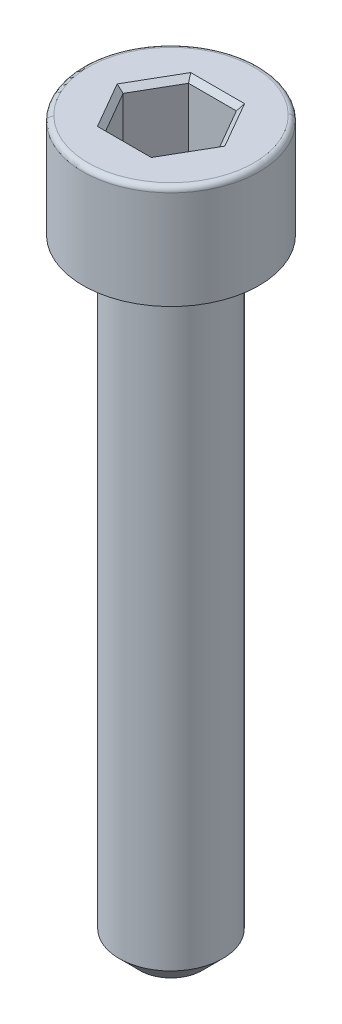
ISO-10303-21;
HEADER;
FILE_DESCRIPTION(('STEP AP214'),'2;1');
FILE_NAME('part.step','',(''),(''),'','','');
FILE_SCHEMA(('AUTOMOTIVE_DESIGN { 1 0 10303 214 1 1 1 1 }'));
ENDSEC;
DATA;
#1=APPLICATION_CONTEXT('core data for automotive mechanical design processes');
#2=APPLICATION_PROTOCOL_DEFINITION('international standard','automotive_design',2000,#1);
#3=PRODUCT_CONTEXT('',#1,'mechanical');
#4=PRODUCT('Part','Part','',(#3));
#5=PRODUCT_RELATED_PRODUCT_CATEGORY('part','',(#4));
#6=PRODUCT_DEFINITION_FORMATION('','',#4);
#7=PRODUCT_DEFINITION_CONTEXT('part definition',#1,'design');
#8=PRODUCT_DEFINITION('design','',#6,#7);
#9=PRODUCT_DEFINITION_SHAPE('','',#8);
#10=(LENGTH_UNIT() NAMED_UNIT(*) SI_UNIT(.MILLI.,.METRE.));
#11=(NAMED_UNIT(*) PLANE_ANGLE_UNIT() SI_UNIT($,.RADIAN.));
#12=(NAMED_UNIT(*) SI_UNIT($,.STERADIAN.) SOLID_ANGLE_UNIT());
#13=UNCERTAINTY_MEASURE_WITH_UNIT(LENGTH_MEASURE(1.E-05),#10,'distance_accuracy_value','');
#14=(GEOMETRIC_REPRESENTATION_CONTEXT(3) GLOBAL_UNCERTAINTY_ASSIGNED_CONTEXT((#13)) GLOBAL_UNIT_ASSIGNED_CONTEXT((#10,
#11,#12)) REPRESENTATION_CONTEXT('',''));
#15=CARTESIAN_POINT('',(0.,0.,0.));
#16=DIRECTION('',(0.,0.,1.));
#17=DIRECTION('',(1.,0.,0.));
#18=AXIS2_PLACEMENT_3D('',#15,#16,#17);
#19=CARTESIAN_POINT('',(32.8952994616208,38.75,7.5));
#20=DIRECTION('',(-0.612372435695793,-0.707106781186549,-0.353553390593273));
#21=DIRECTION('',(-0.5,0.,0.866025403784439));
#22=AXIS2_PLACEMENT_3D('',#19,#20,#21);
#23=PLANE('',#22);
#24=DIRECTION('',(-0.37796447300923,0.654653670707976,-0.654653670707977));
#25=VECTOR('',#24,1.);
#26=CARTESIAN_POINT('',(32.8952994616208,38.75,7.5));
#27=LINE('',#26,#25);
#28=CARTESIAN_POINT('',(32.8952994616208,38.75,7.5));
#29=VERTEX_POINT('',#28);
#30=CARTESIAN_POINT('',(32.7509618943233,39.,7.25));
#31=VERTEX_POINT('',#30);
#32=EDGE_CURVE('E24',#29,#31,#27,.T.);
#33=ORIENTED_EDGE('',*,*,#32,.T.);
#34=DIRECTION('',(0.5,0.,-0.866025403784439));
#35=VECTOR('',#34,1.);
#36=CARTESIAN_POINT('',(32.101442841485,39.,8.375));
#37=LINE('',#36,#35);
#38=CARTESIAN_POINT('',(31.4519237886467,39.,9.5));
#39=VERTEX_POINT('',#38);
#40=EDGE_CURVE('E278',#39,#31,#37,.T.);
#41=ORIENTED_EDGE('',*,*,#40,.F.);
#42=DIRECTION('',(0.755928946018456,-0.654653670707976,0.));
#43=VECTOR('',#42,1.);
#44=CARTESIAN_POINT('',(32.4004278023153,38.1785714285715,9.5));
#45=LINE('',#44,#43);
#46=CARTESIAN_POINT('',(31.7405989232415,38.75,9.5));
#47=VERTEX_POINT('',#46);
#48=EDGE_CURVE('E11',#39,#47,#45,.T.);
#49=ORIENTED_EDGE('',*,*,#48,.T.);
#50=DIRECTION('',(-0.5,0.,0.866025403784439));
#51=VECTOR('',#50,1.);
#52=CARTESIAN_POINT('',(32.8952994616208,38.75,7.5));
#53=LINE('',#52,#51);
#54=EDGE_CURVE('E308',#29,#47,#53,.T.);
#55=ORIENTED_EDGE('',*,*,#54,.F.);
#56=EDGE_LOOP('',(#33,#41,#49,#55));
#57=FACE_BOUND('',#56,.T.);
#58=ADVANCED_FACE('F16',(#57),#23,.F.);
#59=CARTESIAN_POINT('',(31.7405989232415,38.75,9.5));
#60=DIRECTION('',(-0.612372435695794,-0.707106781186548,0.353553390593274));
#61=DIRECTION('',(0.5,0.,0.866025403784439));
#62=AXIS2_PLACEMENT_3D('',#59,#60,#61);
#63=PLANE('',#62);
#64=DIRECTION('',(0.377964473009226,-0.654653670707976,-0.654653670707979));
#65=VECTOR('',#64,1.);
#66=CARTESIAN_POINT('',(32.8952994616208,38.75,11.5));
#67=LINE('',#66,#65);
#68=CARTESIAN_POINT('',(32.7509618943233,39.,11.75));
#69=VERTEX_POINT('',#68);
#70=CARTESIAN_POINT('',(32.8952994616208,38.75,11.5));
#71=VERTEX_POINT('',#70);
#72=EDGE_CURVE('E315',#69,#71,#67,.T.);
#73=ORIENTED_EDGE('',*,*,#72,.T.);
#74=DIRECTION('',(0.5,0.,0.866025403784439));
#75=VECTOR('',#74,1.);
#76=CARTESIAN_POINT('',(31.7405989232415,38.75,9.5));
#77=LINE('',#76,#75);
#78=EDGE_CURVE('E365',#47,#71,#77,.T.);
#79=ORIENTED_EDGE('',*,*,#78,.F.);
#80=ORIENTED_EDGE('',*,*,#48,.F.);
#81=DIRECTION('',(-0.5,0.,-0.866025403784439));
#82=VECTOR('',#81,1.);
#83=CARTESIAN_POINT('',(32.101442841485,39.,10.625));
#84=LINE('',#83,#82);
#85=EDGE_CURVE('E187',#69,#39,#84,.T.);
#86=ORIENTED_EDGE('',*,*,#85,.F.);
#87=EDGE_LOOP('',(#73,#79,#80,#86));
#88=FACE_BOUND('',#87,.T.);
#89=ADVANCED_FACE('F473',(#88),#63,.F.);
#90=CARTESIAN_POINT('',(35.2047005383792,38.75,7.5));
#91=DIRECTION('',(0.,-0.707106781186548,-0.707106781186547));
#92=DIRECTION('',(-1.,0.,0.));
#93=AXIS2_PLACEMENT_3D('',#90,#91,#92);
#94=PLANE('',#93);
#95=DIRECTION('',(0.377964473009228,0.654653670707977,-0.654653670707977));
#96=VECTOR('',#95,1.);
#97=CARTESIAN_POINT('',(35.2047005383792,38.75,7.5));
#98=LINE('',#97,#96);
#99=CARTESIAN_POINT('',(35.2047005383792,38.75,7.5));
#100=VERTEX_POINT('',#99);
#101=CARTESIAN_POINT('',(35.3490381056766,39.,7.25));
#102=VERTEX_POINT('',#101);
#103=EDGE_CURVE('E324',#100,#102,#98,.T.);
#104=ORIENTED_EDGE('',*,*,#103,.T.);
#105=DIRECTION('',(1.,0.,0.));
#106=VECTOR('',#105,1.);
#107=CARTESIAN_POINT('',(34.05,39.,7.25));
#108=LINE('',#107,#106);
#109=EDGE_CURVE('E282',#31,#102,#108,.T.);
#110=ORIENTED_EDGE('',*,*,#109,.F.);
#111=ORIENTED_EDGE('',*,*,#32,.F.);
#112=DIRECTION('',(-1.,0.,0.));
#113=VECTOR('',#112,1.);
#114=CARTESIAN_POINT('',(35.2047005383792,38.75,7.5));
#115=LINE('',#114,#113);
#116=EDGE_CURVE('E331',#100,#29,#115,.T.);
#117=ORIENTED_EDGE('',*,*,#116,.F.);
#118=EDGE_LOOP('',(#104,#110,#111,#117));
#119=FACE_BOUND('',#118,.T.);
#120=ADVANCED_FACE('F453',(#119),#94,.F.);
#121=CARTESIAN_POINT('',(32.8952994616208,38.75,11.5));
#122=DIRECTION('',(0.,-0.707106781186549,0.707106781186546));
#123=DIRECTION('',(1.,0.,0.));
#124=AXIS2_PLACEMENT_3D('',#121,#122,#123);
#125=PLANE('',#124);
#126=DIRECTION('',(-0.377964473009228,-0.654653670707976,-0.654653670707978));
#127=VECTOR('',#126,1.);
#128=CARTESIAN_POINT('',(35.2047005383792,38.75,11.5));
#129=LINE('',#128,#127);
#130=CARTESIAN_POINT('',(35.3490381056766,39.,11.75));
#131=VERTEX_POINT('',#130);
#132=CARTESIAN_POINT('',(35.2047005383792,38.75,11.5));
#133=VERTEX_POINT('',#132);
#134=EDGE_CURVE('E434',#131,#133,#129,.T.);
#135=ORIENTED_EDGE('',*,*,#134,.T.);
#136=DIRECTION('',(1.,0.,0.));
#137=VECTOR('',#136,1.);
#138=CARTESIAN_POINT('',(32.8952994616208,38.75,11.5));
#139=LINE('',#138,#137);
#140=EDGE_CURVE('E283',#71,#133,#139,.T.);
#141=ORIENTED_EDGE('',*,*,#140,.F.);
#142=ORIENTED_EDGE('',*,*,#72,.F.);
#143=DIRECTION('',(-1.,0.,0.));
#144=VECTOR('',#143,1.);
#145=CARTESIAN_POINT('',(34.05,39.,11.75));
#146=LINE('',#145,#144);
#147=EDGE_CURVE('E300',#131,#69,#146,.T.);
#148=ORIENTED_EDGE('',*,*,#147,.F.);
#149=EDGE_LOOP('',(#135,#141,#142,#148));
#150=FACE_BOUND('',#149,.T.);
#151=ADVANCED_FACE('F470',(#150),#125,.F.);
#152=CARTESIAN_POINT('',(36.3594010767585,38.75,9.5));
#153=DIRECTION('',(0.612372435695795,-0.707106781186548,-0.353553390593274));
#154=DIRECTION('',(-0.5,0.,-0.866025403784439));
#155=AXIS2_PLACEMENT_3D('',#152,#153,#154);
#156=PLANE('',#155);
#157=DIRECTION('',(0.755928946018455,0.654653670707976,0.));
#158=VECTOR('',#157,1.);
#159=CARTESIAN_POINT('',(36.3594010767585,38.75,9.5));
#160=LINE('',#159,#158);
#161=CARTESIAN_POINT('',(36.3594010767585,38.75,9.5));
#162=VERTEX_POINT('',#161);
#163=CARTESIAN_POINT('',(36.6480762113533,39.,9.5));
#164=VERTEX_POINT('',#163);
#165=EDGE_CURVE('E327',#162,#164,#160,.T.);
#166=ORIENTED_EDGE('',*,*,#165,.T.);
#167=DIRECTION('',(0.5,0.,0.866025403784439));
#168=VECTOR('',#167,1.);
#169=CARTESIAN_POINT('',(35.998557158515,39.,8.375));
#170=LINE('',#169,#168);
#171=EDGE_CURVE('E292',#102,#164,#170,.T.);
#172=ORIENTED_EDGE('',*,*,#171,.F.);
#173=ORIENTED_EDGE('',*,*,#103,.F.);
#174=DIRECTION('',(-0.5,0.,-0.866025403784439));
#175=VECTOR('',#174,1.);
#176=CARTESIAN_POINT('',(36.3594010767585,38.75,9.5));
#177=LINE('',#176,#175);
#178=EDGE_CURVE('E345',#162,#100,#177,.T.);
#179=ORIENTED_EDGE('',*,*,#178,.F.);
#180=EDGE_LOOP('',(#166,#172,#173,#179));
#181=FACE_BOUND('',#180,.T.);
#182=ADVANCED_FACE('F444',(#181),#156,.F.);
#183=CARTESIAN_POINT('',(35.2047005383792,38.75,11.5));
#184=DIRECTION('',(0.612372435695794,-0.707106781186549,0.353553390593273));
#185=DIRECTION('',(0.5,0.,-0.866025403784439));
#186=AXIS2_PLACEMENT_3D('',#183,#184,#185);
#187=PLANE('',#186);
#188=ORIENTED_EDGE('',*,*,#134,.F.);
#189=DIRECTION('',(-0.5,0.,0.866025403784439));
#190=VECTOR('',#189,1.);
#191=CARTESIAN_POINT('',(35.998557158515,39.,10.625));
#192=LINE('',#191,#190);
#193=EDGE_CURVE('E296',#164,#131,#192,.T.);
#194=ORIENTED_EDGE('',*,*,#193,.F.);
#195=ORIENTED_EDGE('',*,*,#165,.F.);
#196=DIRECTION('',(0.5,0.,-0.866025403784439));
#197=VECTOR('',#196,1.);
#198=CARTESIAN_POINT('',(35.2047005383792,38.75,11.5));
#199=LINE('',#198,#197);
#200=EDGE_CURVE('E240',#133,#162,#199,.T.);
#201=ORIENTED_EDGE('',*,*,#200,.F.);
#202=EDGE_LOOP('',(#188,#194,#195,#201));
#203=FACE_BOUND('',#202,.T.);
#204=ADVANCED_FACE('F447',(#203),#187,.F.);
#205=CARTESIAN_POINT('',(34.9881941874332,35.75,7.625));
#206=DIRECTION('',(-0.5,0.,-0.866025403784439));
#207=DIRECTION('',(0.866025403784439,0.,-0.5));
#208=AXIS2_PLACEMENT_3D('',#205,#206,#207);
#209=CYLINDRICAL_SURFACE('',#208,0.25);
#210=CARTESIAN_POINT('',(36.0707259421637,35.5,9.5));
#211=CARTESIAN_POINT('',(36.2398279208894,35.5000000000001,9.5));
#212=CARTESIAN_POINT('',(36.3594010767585,35.6035533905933,9.5));
#213=CARTESIAN_POINT('',(36.3594010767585,35.75,9.5));
#214=(BOUNDED_CURVE() B_SPLINE_CURVE(3,(#210,#211,#212,#213),.UNSPECIFIED.,.F.,
.F.) B_SPLINE_CURVE_WITH_KNOTS((4,4),(1.5707963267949,3.1415926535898),
.UNSPECIFIED.) CURVE() GEOMETRIC_REPRESENTATION_ITEM() RATIONAL_B_SPLINE_CURVE((1.,
0.804737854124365,0.804737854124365,1.)) REPRESENTATION_ITEM(''));
#215=CARTESIAN_POINT('',(36.0707259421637,35.5,9.5));
#216=VERTEX_POINT('',#215);
#217=CARTESIAN_POINT('',(36.3594010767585,35.75,9.5));
#218=VERTEX_POINT('',#217);
#219=EDGE_CURVE('E418',#216,#218,#214,.T.);
#220=ORIENTED_EDGE('',*,*,#219,.T.);
#221=DIRECTION('',(0.5,0.,0.866025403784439));
#222=VECTOR('',#221,1.);
#223=CARTESIAN_POINT('',(36.3594010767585,35.75,9.5));
#224=LINE('',#223,#222);
#225=CARTESIAN_POINT('',(35.2047005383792,35.75,7.5));
#226=VERTEX_POINT('',#225);
#227=EDGE_CURVE('E349',#226,#218,#224,.T.);
#228=ORIENTED_EDGE('',*,*,#227,.F.);
#229=CARTESIAN_POINT('',(35.2047005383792,35.75,7.5));
#230=CARTESIAN_POINT('',(35.2047005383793,35.6035533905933,7.49999999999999));
#231=CARTESIAN_POINT('',(35.1449139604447,35.5,7.60355339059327));
#232=CARTESIAN_POINT('',(35.0603629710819,35.5,7.75));
#233=(BOUNDED_CURVE() B_SPLINE_CURVE(3,(#229,#230,#231,#232),.UNSPECIFIED.,.F.,
.F.) B_SPLINE_CURVE_WITH_KNOTS((4,4),(0.,1.5707963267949),
.UNSPECIFIED.) CURVE() GEOMETRIC_REPRESENTATION_ITEM() RATIONAL_B_SPLINE_CURVE((1.,
0.804737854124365,0.804737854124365,1.)) REPRESENTATION_ITEM(''));
#234=CARTESIAN_POINT('',(35.0603629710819,35.5,7.75));
#235=VERTEX_POINT('',#234);
#236=EDGE_CURVE('E426',#226,#235,#233,.T.);
#237=ORIENTED_EDGE('',*,*,#236,.T.);
#238=DIRECTION('',(-0.5,0.,-0.866025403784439));
#239=VECTOR('',#238,1.);
#240=CARTESIAN_POINT('',(34.9881941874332,35.5,7.625));
#241=LINE('',#240,#239);
#242=EDGE_CURVE('E260',#216,#235,#241,.T.);
#243=ORIENTED_EDGE('',*,*,#242,.F.);
#244=EDGE_LOOP('',(#220,#228,#237,#243));
#245=FACE_BOUND('',#244,.T.);
#246=ADVANCED_FACE('F489',(#245),#209,.F.);
#247=CARTESIAN_POINT('',(31.7405989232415,35.75,7.75));
#248=DIRECTION('',(-1.,0.,0.));
#249=DIRECTION('',(0.,0.,-1.));
#250=AXIS2_PLACEMENT_3D('',#247,#248,#249);
#251=CYLINDRICAL_SURFACE('',#250,0.25);
#252=CARTESIAN_POINT('',(32.8952994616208,35.75,7.5));
#253=CARTESIAN_POINT('',(32.8952994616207,35.6035533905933,7.5));
#254=CARTESIAN_POINT('',(32.9550860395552,35.5000000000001,7.60355339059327));
#255=CARTESIAN_POINT('',(33.0396370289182,35.5,7.75));
#256=(BOUNDED_CURVE() B_SPLINE_CURVE(3,(#252,#253,#254,#255),.UNSPECIFIED.,.F.,
.F.) B_SPLINE_CURVE_WITH_KNOTS((4,4),(0.,1.5707963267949),
.UNSPECIFIED.) CURVE() GEOMETRIC_REPRESENTATION_ITEM() RATIONAL_B_SPLINE_CURVE((1.,
0.804737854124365,0.804737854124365,1.)) REPRESENTATION_ITEM(''));
#257=CARTESIAN_POINT('',(32.8952994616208,35.75,7.5));
#258=VERTEX_POINT('',#257);
#259=CARTESIAN_POINT('',(33.0396370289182,35.5,7.75));
#260=VERTEX_POINT('',#259);
#261=EDGE_CURVE('E410',#258,#260,#256,.T.);
#262=ORIENTED_EDGE('',*,*,#261,.T.);
#263=DIRECTION('',(-1.,0.,0.));
#264=VECTOR('',#263,1.);
#265=CARTESIAN_POINT('',(31.7405989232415,35.5,7.75));
#266=LINE('',#265,#264);
#267=EDGE_CURVE('E264',#235,#260,#266,.T.);
#268=ORIENTED_EDGE('',*,*,#267,.F.);
#269=ORIENTED_EDGE('',*,*,#236,.F.);
#270=DIRECTION('',(1.,0.,0.));
#271=VECTOR('',#270,1.);
#272=CARTESIAN_POINT('',(35.2047005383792,35.75,7.5));
#273=LINE('',#272,#271);
#274=EDGE_CURVE('E337',#258,#226,#273,.T.);
#275=ORIENTED_EDGE('',*,*,#274,.F.);
#276=EDGE_LOOP('',(#262,#268,#269,#275));
#277=FACE_BOUND('',#276,.T.);
#278=ADVANCED_FACE('F485',(#277),#251,.F.);
#279=CARTESIAN_POINT('',(34.9881941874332,35.75,11.375));
#280=DIRECTION('',(0.5,0.,-0.866025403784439));
#281=DIRECTION('',(0.866025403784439,0.,0.5));
#282=AXIS2_PLACEMENT_3D('',#279,#280,#281);
#283=CYLINDRICAL_SURFACE('',#282,0.25);
#284=CARTESIAN_POINT('',(35.0603629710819,35.5,11.25));
#285=CARTESIAN_POINT('',(35.1449139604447,35.5000000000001,11.3964466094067));
#286=CARTESIAN_POINT('',(35.2047005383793,35.6035533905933,11.5));
#287=CARTESIAN_POINT('',(35.2047005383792,35.75,11.5));
#288=(BOUNDED_CURVE() B_SPLINE_CURVE(3,(#284,#285,#286,#287),.UNSPECIFIED.,.F.,
.F.) B_SPLINE_CURVE_WITH_KNOTS((4,4),(4.71238898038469,6.28318530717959),
.UNSPECIFIED.) CURVE() GEOMETRIC_REPRESENTATION_ITEM() RATIONAL_B_SPLINE_CURVE((1.,
0.804737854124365,0.804737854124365,1.)) REPRESENTATION_ITEM(''));
#289=CARTESIAN_POINT('',(35.0603629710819,35.5,11.25));
#290=VERTEX_POINT('',#289);
#291=CARTESIAN_POINT('',(35.2047005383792,35.75,11.5));
#292=VERTEX_POINT('',#291);
#293=EDGE_CURVE('E402',#290,#292,#288,.T.);
#294=ORIENTED_EDGE('',*,*,#293,.T.);
#295=DIRECTION('',(-0.5,0.,0.866025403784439));
#296=VECTOR('',#295,1.);
#297=CARTESIAN_POINT('',(35.2047005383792,35.75,11.5));
#298=LINE('',#297,#296);
#299=EDGE_CURVE('E244',#218,#292,#298,.T.);
#300=ORIENTED_EDGE('',*,*,#299,.F.);
#301=ORIENTED_EDGE('',*,*,#219,.F.);
#302=DIRECTION('',(0.5,0.,-0.866025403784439));
#303=VECTOR('',#302,1.);
#304=CARTESIAN_POINT('',(34.9881941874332,35.5,11.375));
#305=LINE('',#304,#303);
#306=EDGE_CURVE('E265',#290,#216,#305,.T.);
#307=ORIENTED_EDGE('',*,*,#306,.F.);
#308=EDGE_LOOP('',(#294,#300,#301,#307));
#309=FACE_BOUND('',#308,.T.);
#310=ADVANCED_FACE('F492',(#309),#283,.F.);
#311=CARTESIAN_POINT('',(31.9571052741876,35.75,9.625));
#312=DIRECTION('',(-0.5,0.,0.866025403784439));
#313=DIRECTION('',(-0.866025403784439,0.,-0.5));
#314=AXIS2_PLACEMENT_3D('',#311,#312,#313);
#315=CYLINDRICAL_SURFACE('',#314,0.25);
#316=CARTESIAN_POINT('',(31.7405989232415,35.75,9.5));
#317=CARTESIAN_POINT('',(31.7405989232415,35.6035533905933,9.5));
#318=CARTESIAN_POINT('',(31.8601720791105,35.5000000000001,9.5));
#319=CARTESIAN_POINT('',(32.0292740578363,35.5,9.5));
#320=(BOUNDED_CURVE() B_SPLINE_CURVE(3,(#316,#317,#318,#319),.UNSPECIFIED.,.F.,
.F.) B_SPLINE_CURVE_WITH_KNOTS((4,4),(0.,1.5707963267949),
.UNSPECIFIED.) CURVE() GEOMETRIC_REPRESENTATION_ITEM() RATIONAL_B_SPLINE_CURVE((1.,
0.804737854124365,0.804737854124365,1.)) REPRESENTATION_ITEM(''));
#321=CARTESIAN_POINT('',(31.7405989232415,35.75,9.5));
#322=VERTEX_POINT('',#321);
#323=CARTESIAN_POINT('',(32.0292740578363,35.5,9.5));
#324=VERTEX_POINT('',#323);
#325=EDGE_CURVE('E43',#322,#324,#320,.T.);
#326=ORIENTED_EDGE('',*,*,#325,.T.);
#327=DIRECTION('',(-0.5,0.,0.866025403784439));
#328=VECTOR('',#327,1.);
#329=CARTESIAN_POINT('',(31.9571052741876,35.5,9.625));
#330=LINE('',#329,#328);
#331=EDGE_CURVE('E379',#260,#324,#330,.T.);
#332=ORIENTED_EDGE('',*,*,#331,.F.);
#333=ORIENTED_EDGE('',*,*,#261,.F.);
#334=DIRECTION('',(0.5,0.,-0.866025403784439));
#335=VECTOR('',#334,1.);
#336=CARTESIAN_POINT('',(32.8952994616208,35.75,7.5));
#337=LINE('',#336,#335);
#338=EDGE_CURVE('E319',#322,#258,#337,.T.);
#339=ORIENTED_EDGE('',*,*,#338,.F.);
#340=EDGE_LOOP('',(#326,#332,#333,#339));
#341=FACE_BOUND('',#340,.T.);
#342=ADVANCED_FACE('F498',(#341),#315,.F.);
#343=CARTESIAN_POINT('',(31.7405989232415,35.75,11.25));
#344=DIRECTION('',(1.,0.,0.));
#345=DIRECTION('',(0.,0.,1.));
#346=AXIS2_PLACEMENT_3D('',#343,#344,#345);
#347=CYLINDRICAL_SURFACE('',#346,0.25);
#348=CARTESIAN_POINT('',(33.0396370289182,35.5,11.25));
#349=CARTESIAN_POINT('',(32.9550860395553,35.5,11.3964466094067));
#350=CARTESIAN_POINT('',(32.8952994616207,35.6035533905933,11.5));
#351=CARTESIAN_POINT('',(32.8952994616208,35.75,11.5));
#352=(BOUNDED_CURVE() B_SPLINE_CURVE(3,(#348,#349,#350,#351),.UNSPECIFIED.,.F.,
.F.) B_SPLINE_CURVE_WITH_KNOTS((4,4),(4.71238898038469,6.28318530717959),
.UNSPECIFIED.) CURVE() GEOMETRIC_REPRESENTATION_ITEM() RATIONAL_B_SPLINE_CURVE((1.,
0.804737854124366,0.804737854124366,1.)) REPRESENTATION_ITEM(''));
#353=CARTESIAN_POINT('',(33.0396370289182,35.5,11.25));
#354=VERTEX_POINT('',#353);
#355=CARTESIAN_POINT('',(32.8952994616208,35.75,11.5));
#356=VERTEX_POINT('',#355);
#357=EDGE_CURVE('E34',#354,#356,#352,.T.);
#358=ORIENTED_EDGE('',*,*,#357,.T.);
#359=DIRECTION('',(-1.,0.,0.));
#360=VECTOR('',#359,1.);
#361=CARTESIAN_POINT('',(32.8952994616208,35.75,11.5));
#362=LINE('',#361,#360);
#363=EDGE_CURVE('E287',#292,#356,#362,.T.);
#364=ORIENTED_EDGE('',*,*,#363,.F.);
#365=ORIENTED_EDGE('',*,*,#293,.F.);
#366=DIRECTION('',(1.,0.,0.));
#367=VECTOR('',#366,1.);
#368=CARTESIAN_POINT('',(31.7405989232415,35.5,11.25));
#369=LINE('',#368,#367);
#370=EDGE_CURVE('E387',#354,#290,#369,.T.);
#371=ORIENTED_EDGE('',*,*,#370,.F.);
#372=EDGE_LOOP('',(#358,#364,#365,#371));
#373=FACE_BOUND('',#372,.T.);
#374=ADVANCED_FACE('F494',(#373),#347,.F.);
#375=CARTESIAN_POINT('',(31.9571052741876,35.75,9.375));
#376=DIRECTION('',(0.5,0.,0.866025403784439));
#377=DIRECTION('',(-0.866025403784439,0.,0.5));
#378=AXIS2_PLACEMENT_3D('',#375,#376,#377);
#379=CYLINDRICAL_SURFACE('',#378,0.25);
#380=ORIENTED_EDGE('',*,*,#325,.F.);
#381=DIRECTION('',(-0.5,0.,-0.866025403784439));
#382=VECTOR('',#381,1.);
#383=CARTESIAN_POINT('',(31.7405989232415,35.75,9.5));
#384=LINE('',#383,#382);
#385=EDGE_CURVE('E369',#356,#322,#384,.T.);
#386=ORIENTED_EDGE('',*,*,#385,.F.);
#387=ORIENTED_EDGE('',*,*,#357,.F.);
#388=DIRECTION('',(0.5,0.,0.866025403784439));
#389=VECTOR('',#388,1.);
#390=CARTESIAN_POINT('',(31.9571052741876,35.5,9.375));
#391=LINE('',#390,#389);
#392=EDGE_CURVE('E383',#324,#354,#391,.T.);
#393=ORIENTED_EDGE('',*,*,#392,.F.);
#394=EDGE_LOOP('',(#380,#386,#387,#393));
#395=FACE_BOUND('',#394,.T.);
#396=ADVANCED_FACE('F495',(#395),#379,.F.);
#397=CARTESIAN_POINT('',(34.05,38.75,9.5));
#398=DIRECTION('',(0.,-1.,0.));
#399=DIRECTION('',(0.696510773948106,0.,-0.717546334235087));
#400=AXIS2_PLACEMENT_3D('',#397,#398,#399);
#401=TOROIDAL_SURFACE('',#400,4.,0.25);
#402=CARTESIAN_POINT('',(31.2639569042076,38.75,12.3701853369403));
#403=DIRECTION('',(0.717546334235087,0.,0.696510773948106));
#404=DIRECTION('',(-0.696510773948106,0.,0.717546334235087));
#405=AXIS2_PLACEMENT_3D('',#402,#403,#404);
#406=CIRCLE('',#405,0.25);
#407=CARTESIAN_POINT('',(31.2639569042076,39.,12.3701853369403));
#408=VERTEX_POINT('',#407);
#409=CARTESIAN_POINT('',(31.0898292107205,38.75,12.5495719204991));
#410=VERTEX_POINT('',#409);
#411=EDGE_CURVE('E191',#408,#410,#406,.T.);
#412=ORIENTED_EDGE('',*,*,#411,.F.);
#413=CARTESIAN_POINT('',(34.05,39.,9.5));
#414=DIRECTION('',(0.,1.,0.));
#415=DIRECTION('',(0.696510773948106,0.,-0.717546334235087));
#416=AXIS2_PLACEMENT_3D('',#413,#414,#415);
#417=CIRCLE('',#416,4.);
#418=CARTESIAN_POINT('',(36.8360430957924,39.,6.62981466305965));
#419=VERTEX_POINT('',#418);
#420=EDGE_CURVE('E178',#419,#408,#417,.T.);
#421=ORIENTED_EDGE('',*,*,#420,.F.);
#422=CARTESIAN_POINT('',(36.8360430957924,38.75,6.62981466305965));
#423=DIRECTION('',(-0.717546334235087,0.,-0.696510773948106));
#424=DIRECTION('',(0.,1.,0.));
#425=AXIS2_PLACEMENT_3D('',#422,#423,#424);
#426=CIRCLE('',#425,0.25);
#427=CARTESIAN_POINT('',(37.0101707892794,38.75,6.45042807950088));
#428=VERTEX_POINT('',#427);
#429=EDGE_CURVE('E200',#419,#428,#426,.T.);
#430=ORIENTED_EDGE('',*,*,#429,.T.);
#431=CARTESIAN_POINT('',(34.05,38.75,9.5));
#432=DIRECTION('',(0.,-1.,0.));
#433=DIRECTION('',(0.696510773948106,0.,-0.717546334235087));
#434=AXIS2_PLACEMENT_3D('',#431,#432,#433);
#435=CIRCLE('',#434,4.25);
#436=EDGE_CURVE('E188',#410,#428,#435,.T.);
#437=ORIENTED_EDGE('',*,*,#436,.F.);
#438=EDGE_LOOP('',(#412,#421,#430,#437));
#439=FACE_BOUND('',#438,.T.);
#440=ADVANCED_FACE('F192',(#439),#401,.T.);
#441=CARTESIAN_POINT('',(34.05,4.,9.5));
#442=DIRECTION('',(0.,1.,0.));
#443=DIRECTION('',(-0.696510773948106,0.,0.717546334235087));
#444=AXIS2_PLACEMENT_3D('',#441,#442,#443);
#445=CONICAL_SURFACE('',#444,1.49999999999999,0.785398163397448);
#446=DIRECTION('',(0.492507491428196,0.707106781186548,-0.507381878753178));
#447=VECTOR('',#446,1.);
#448=CARTESIAN_POINT('',(35.0947661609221,4.,8.42368049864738));
#449=LINE('',#448,#447);
#450=CARTESIAN_POINT('',(35.0947661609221,4.,8.42368049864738));
#451=VERTEX_POINT('',#450);
#452=CARTESIAN_POINT('',(35.7912769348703,5.,7.70613416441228));
#453=VERTEX_POINT('',#452);
#454=EDGE_CURVE('E223',#451,#453,#449,.T.);
#455=ORIENTED_EDGE('',*,*,#454,.F.);
#456=CARTESIAN_POINT('',(34.05,4.,9.5));
#457=DIRECTION('',(0.,-1.,0.));
#458=DIRECTION('',(0.696510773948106,0.,-0.717546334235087));
#459=AXIS2_PLACEMENT_3D('',#456,#457,#458);
#460=CIRCLE('',#459,1.49999999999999);
#461=CARTESIAN_POINT('',(33.0052338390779,4.,10.5763195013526));
#462=VERTEX_POINT('',#461);
#463=EDGE_CURVE('E256',#462,#451,#460,.T.);
#464=ORIENTED_EDGE('',*,*,#463,.F.);
#465=DIRECTION('',(-0.492507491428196,0.707106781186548,0.507381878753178));
#466=VECTOR('',#465,1.);
#467=CARTESIAN_POINT('',(33.0052338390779,4.,10.5763195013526));
#468=LINE('',#467,#466);
#469=CARTESIAN_POINT('',(32.3087230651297,5.,11.2938658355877));
#470=VERTEX_POINT('',#469);
#471=EDGE_CURVE('E231',#462,#470,#468,.T.);
#472=ORIENTED_EDGE('',*,*,#471,.T.);
#473=CARTESIAN_POINT('',(34.05,5.,9.5));
#474=DIRECTION('',(0.,1.,0.));
#475=DIRECTION('',(0.696510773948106,0.,-0.717546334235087));
#476=AXIS2_PLACEMENT_3D('',#473,#474,#475);
#477=CIRCLE('',#476,2.5);
#478=EDGE_CURVE('E213',#453,#470,#477,.T.);
#479=ORIENTED_EDGE('',*,*,#478,.F.);
#480=EDGE_LOOP('',(#455,#464,#472,#479));
#481=FACE_BOUND('',#480,.T.);
#482=ADVANCED_FACE('F502',(#481),#445,.T.);
#483=CARTESIAN_POINT('',(31.7405989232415,35.5,9.5));
#484=DIRECTION('',(0.,1.,0.));
#485=DIRECTION('',(-0.717546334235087,0.,-0.696510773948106));
#486=AXIS2_PLACEMENT_3D('',#483,#484,#485);
#487=PLANE('',#486);
#488=ORIENTED_EDGE('',*,*,#306,.T.);
#489=ORIENTED_EDGE('',*,*,#242,.T.);
#490=ORIENTED_EDGE('',*,*,#267,.T.);
#491=ORIENTED_EDGE('',*,*,#331,.T.);
#492=ORIENTED_EDGE('',*,*,#392,.T.);
#493=ORIENTED_EDGE('',*,*,#370,.T.);
#494=EDGE_LOOP('',(#488,#489,#490,#491,#492,#493));
#495=FACE_BOUND('',#494,.T.);
#496=ADVANCED_FACE('F500',(#495),#487,.T.);
#497=CARTESIAN_POINT('',(31.7405989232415,35.5,9.5));
#498=DIRECTION('',(-0.866025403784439,0.,0.5));
#499=DIRECTION('',(0.5,0.,0.866025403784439));
#500=AXIS2_PLACEMENT_3D('',#497,#498,#499);
#501=PLANE('',#500);
#502=DIRECTION('',(0.,1.,0.));
#503=VECTOR('',#502,1.);
#504=CARTESIAN_POINT('',(31.7405989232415,35.5,9.5));
#505=LINE('',#504,#503);
#506=EDGE_CURVE('E312',#322,#47,#505,.T.);
#507=ORIENTED_EDGE('',*,*,#506,.T.);
#508=ORIENTED_EDGE('',*,*,#78,.T.);
#509=DIRECTION('',(0.,1.,0.));
#510=VECTOR('',#509,1.);
#511=CARTESIAN_POINT('',(32.8952994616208,35.5,11.5));
#512=LINE('',#511,#510);
#513=EDGE_CURVE('E288',#356,#71,#512,.T.);
#514=ORIENTED_EDGE('',*,*,#513,.F.);
#515=ORIENTED_EDGE('',*,*,#385,.T.);
#516=EDGE_LOOP('',(#507,#508,#514,#515));
#517=FACE_BOUND('',#516,.T.);
#518=ADVANCED_FACE('F497',(#517),#501,.F.);
#519=CARTESIAN_POINT('',(32.8952994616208,35.5,11.5));
#520=DIRECTION('',(0.,0.,1.));
#521=DIRECTION('',(0.,-1.,0.));
#522=AXIS2_PLACEMENT_3D('',#519,#520,#521);
#523=PLANE('',#522);
#524=ORIENTED_EDGE('',*,*,#513,.T.);
#525=ORIENTED_EDGE('',*,*,#140,.T.);
#526=DIRECTION('',(0.,1.,0.));
#527=VECTOR('',#526,1.);
#528=CARTESIAN_POINT('',(35.2047005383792,35.5,11.5));
#529=LINE('',#528,#527);
#530=EDGE_CURVE('E245',#292,#133,#529,.T.);
#531=ORIENTED_EDGE('',*,*,#530,.F.);
#532=ORIENTED_EDGE('',*,*,#363,.T.);
#533=EDGE_LOOP('',(#524,#525,#531,#532));
#534=FACE_BOUND('',#533,.T.);
#535=ADVANCED_FACE('F465',(#534),#523,.F.);
#536=CARTESIAN_POINT('',(35.2047005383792,35.5,11.5));
#537=DIRECTION('',(0.866025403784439,0.,0.5));
#538=DIRECTION('',(0.,1.,0.));
#539=AXIS2_PLACEMENT_3D('',#536,#537,#538);
#540=PLANE('',#539);
#541=ORIENTED_EDGE('',*,*,#530,.T.);
#542=ORIENTED_EDGE('',*,*,#200,.T.);
#543=DIRECTION('',(0.,1.,0.));
#544=VECTOR('',#543,1.);
#545=CARTESIAN_POINT('',(36.3594010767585,35.5,9.5));
#546=LINE('',#545,#544);
#547=EDGE_CURVE('E341',#218,#162,#546,.T.);
#548=ORIENTED_EDGE('',*,*,#547,.F.);
#549=ORIENTED_EDGE('',*,*,#299,.T.);
#550=EDGE_LOOP('',(#541,#542,#548,#549));
#551=FACE_BOUND('',#550,.T.);
#552=ADVANCED_FACE('F461',(#551),#540,.F.);
#553=CARTESIAN_POINT('',(36.3594010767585,35.5,9.5));
#554=DIRECTION('',(0.866025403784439,0.,-0.5));
#555=DIRECTION('',(0.,1.,0.));
#556=AXIS2_PLACEMENT_3D('',#553,#554,#555);
#557=PLANE('',#556);
#558=ORIENTED_EDGE('',*,*,#547,.T.);
#559=ORIENTED_EDGE('',*,*,#178,.T.);
#560=DIRECTION('',(0.,1.,0.));
#561=VECTOR('',#560,1.);
#562=CARTESIAN_POINT('',(35.2047005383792,35.5,7.5));
#563=LINE('',#562,#561);
#564=EDGE_CURVE('E323',#226,#100,#563,.T.);
#565=ORIENTED_EDGE('',*,*,#564,.F.);
#566=ORIENTED_EDGE('',*,*,#227,.T.);
#567=EDGE_LOOP('',(#558,#559,#565,#566));
#568=FACE_BOUND('',#567,.T.);
#569=ADVANCED_FACE('F457',(#568),#557,.F.);
#570=CARTESIAN_POINT('',(35.2047005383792,35.5,7.5));
#571=DIRECTION('',(0.,0.,-1.));
#572=DIRECTION('',(0.,1.,0.));
#573=AXIS2_PLACEMENT_3D('',#570,#571,#572);
#574=PLANE('',#573);
#575=ORIENTED_EDGE('',*,*,#564,.T.);
#576=ORIENTED_EDGE('',*,*,#116,.T.);
#577=DIRECTION('',(0.,1.,0.));
#578=VECTOR('',#577,1.);
#579=CARTESIAN_POINT('',(32.8952994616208,35.5,7.5));
#580=LINE('',#579,#578);
#581=EDGE_CURVE('E304',#258,#29,#580,.T.);
#582=ORIENTED_EDGE('',*,*,#581,.F.);
#583=ORIENTED_EDGE('',*,*,#274,.T.);
#584=EDGE_LOOP('',(#575,#576,#582,#583));
#585=FACE_BOUND('',#584,.T.);
#586=ADVANCED_FACE('F482',(#585),#574,.F.);
#587=CARTESIAN_POINT('',(32.8952994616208,35.5,7.5));
#588=DIRECTION('',(-0.866025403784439,0.,-0.5));
#589=DIRECTION('',(-0.5,0.,0.866025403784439));
#590=AXIS2_PLACEMENT_3D('',#587,#588,#589);
#591=PLANE('',#590);
#592=ORIENTED_EDGE('',*,*,#581,.T.);
#593=ORIENTED_EDGE('',*,*,#54,.T.);
#594=ORIENTED_EDGE('',*,*,#506,.F.);
#595=ORIENTED_EDGE('',*,*,#338,.T.);
#596=EDGE_LOOP('',(#592,#593,#594,#595));
#597=FACE_BOUND('',#596,.T.);
#598=ADVANCED_FACE('F480',(#597),#591,.F.);
#599=CARTESIAN_POINT('',(34.05,39.,9.5));
#600=DIRECTION('',(0.,-1.,0.));
#601=DIRECTION('',(0.696510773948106,0.,-0.717546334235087));
#602=AXIS2_PLACEMENT_3D('',#599,#600,#601);
#603=PLANE('',#602);
#604=ORIENTED_EDGE('',*,*,#85,.T.);
#605=ORIENTED_EDGE('',*,*,#40,.T.);
#606=ORIENTED_EDGE('',*,*,#109,.T.);
#607=ORIENTED_EDGE('',*,*,#171,.T.);
#608=ORIENTED_EDGE('',*,*,#193,.T.);
#609=ORIENTED_EDGE('',*,*,#147,.T.);
#610=EDGE_LOOP('',(#604,#605,#606,#607,#608,#609));
#611=FACE_BOUND('',#610,.T.);
#612=ORIENTED_EDGE('',*,*,#420,.T.);
#613=CARTESIAN_POINT('',(34.05,39.,9.5));
#614=DIRECTION('',(0.,1.,0.));
#615=DIRECTION('',(0.696510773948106,0.,-0.717546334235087));
#616=AXIS2_PLACEMENT_3D('',#613,#614,#615);
#617=CIRCLE('',#616,4.);
#618=EDGE_CURVE('E182',#408,#419,#617,.T.);
#619=ORIENTED_EDGE('',*,*,#618,.T.);
#620=EDGE_LOOP('',(#612,#619));
#621=FACE_BOUND('',#620,.T.);
#622=ADVANCED_FACE('F180',(#611,#621),#603,.F.);
#623=CARTESIAN_POINT('',(34.05,39.,9.5));
#624=DIRECTION('',(0.,-1.,0.));
#625=DIRECTION('',(0.696510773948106,0.,-0.717546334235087));
#626=AXIS2_PLACEMENT_3D('',#623,#624,#625);
#627=CYLINDRICAL_SURFACE('',#626,4.25);
#628=DIRECTION('',(0.,-1.,0.));
#629=VECTOR('',#628,1.);
#630=CARTESIAN_POINT('',(31.0898292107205,39.,12.5495719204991));
#631=LINE('',#630,#629);
#632=CARTESIAN_POINT('',(31.0898292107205,34.,12.5495719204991));
#633=VERTEX_POINT('',#632);
#634=EDGE_CURVE('E235',#410,#633,#631,.T.);
#635=ORIENTED_EDGE('',*,*,#634,.F.);
#636=ORIENTED_EDGE('',*,*,#436,.T.);
#637=DIRECTION('',(0.,-1.,0.));
#638=VECTOR('',#637,1.);
#639=CARTESIAN_POINT('',(37.0101707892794,39.,6.45042807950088));
#640=LINE('',#639,#638);
#641=CARTESIAN_POINT('',(37.0101707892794,34.,6.45042807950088));
#642=VERTEX_POINT('',#641);
#643=EDGE_CURVE('E249',#428,#642,#640,.T.);
#644=ORIENTED_EDGE('',*,*,#643,.T.);
#645=CARTESIAN_POINT('',(34.05,34.,9.5));
#646=DIRECTION('',(0.,-1.,0.));
#647=DIRECTION('',(0.696510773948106,0.,-0.717546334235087));
#648=AXIS2_PLACEMENT_3D('',#645,#646,#647);
#649=CIRCLE('',#648,4.25);
#650=EDGE_CURVE('E270',#633,#642,#649,.T.);
#651=ORIENTED_EDGE('',*,*,#650,.F.);
#652=EDGE_LOOP('',(#635,#636,#644,#651));
#653=FACE_BOUND('',#652,.T.);
#654=ADVANCED_FACE('F529',(#653),#627,.T.);
#655=CARTESIAN_POINT('',(34.05,34.,9.5));
#656=DIRECTION('',(0.,-1.,0.));
#657=DIRECTION('',(0.696510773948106,0.,-0.717546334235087));
#658=AXIS2_PLACEMENT_3D('',#655,#656,#657);
#659=PLANE('',#658);
#660=CARTESIAN_POINT('',(34.05,34.,9.5));
#661=DIRECTION('',(0.,-1.,0.));
#662=DIRECTION('',(0.696510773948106,0.,-0.717546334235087));
#663=AXIS2_PLACEMENT_3D('',#660,#661,#662);
#664=CIRCLE('',#663,2.5);
#665=CARTESIAN_POINT('',(32.3087230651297,34.,11.2938658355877));
#666=VERTEX_POINT('',#665);
#667=CARTESIAN_POINT('',(35.7912769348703,34.,7.70613416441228));
#668=VERTEX_POINT('',#667);
#669=EDGE_CURVE('E253',#666,#668,#664,.T.);
#670=ORIENTED_EDGE('',*,*,#669,.F.);
#671=CARTESIAN_POINT('',(34.05,34.,9.5));
#672=DIRECTION('',(0.,-1.,0.));
#673=DIRECTION('',(0.696510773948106,0.,-0.717546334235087));
#674=AXIS2_PLACEMENT_3D('',#671,#672,#673);
#675=CIRCLE('',#674,2.5);
#676=EDGE_CURVE('E205',#668,#666,#675,.T.);
#677=ORIENTED_EDGE('',*,*,#676,.F.);
#678=EDGE_LOOP('',(#670,#677));
#679=FACE_BOUND('',#678,.T.);
#680=CARTESIAN_POINT('',(34.05,34.,9.5));
#681=DIRECTION('',(0.,-1.,0.));
#682=DIRECTION('',(0.696510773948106,0.,-0.717546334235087));
#683=AXIS2_PLACEMENT_3D('',#680,#681,#682);
#684=CIRCLE('',#683,4.25);
#685=EDGE_CURVE('E239',#642,#633,#684,.T.);
#686=ORIENTED_EDGE('',*,*,#685,.T.);
#687=ORIENTED_EDGE('',*,*,#650,.T.);
#688=EDGE_LOOP('',(#686,#687));
#689=FACE_BOUND('',#688,.T.);
#690=ADVANCED_FACE('F533',(#679,#689),#659,.T.);
#691=CARTESIAN_POINT('',(34.05,4.,9.5));
#692=DIRECTION('',(0.,-1.,0.));
#693=DIRECTION('',(0.696510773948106,0.,-0.717546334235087));
#694=AXIS2_PLACEMENT_3D('',#691,#692,#693);
#695=PLANE('',#694);
#696=ORIENTED_EDGE('',*,*,#463,.T.);
#697=CARTESIAN_POINT('',(34.05,4.,9.5));
#698=DIRECTION('',(0.,-1.,0.));
#699=DIRECTION('',(0.696510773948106,0.,-0.717546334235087));
#700=AXIS2_PLACEMENT_3D('',#697,#698,#699);
#701=CIRCLE('',#700,1.49999999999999);
#702=EDGE_CURVE('E219',#451,#462,#701,.T.);
#703=ORIENTED_EDGE('',*,*,#702,.T.);
#704=EDGE_LOOP('',(#696,#703));
#705=FACE_BOUND('',#704,.T.);
#706=ADVANCED_FACE('F530',(#705),#695,.T.);
#707=CARTESIAN_POINT('',(34.05,4.,9.5));
#708=DIRECTION('',(0.,1.,0.));
#709=DIRECTION('',(-0.696510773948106,0.,0.717546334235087));
#710=AXIS2_PLACEMENT_3D('',#707,#708,#709);
#711=CYLINDRICAL_SURFACE('',#710,2.5);
#712=DIRECTION('',(0.,1.,0.));
#713=VECTOR('',#712,1.);
#714=CARTESIAN_POINT('',(35.7912769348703,4.,7.70613416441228));
#715=LINE('',#714,#713);
#716=EDGE_CURVE('E208',#453,#668,#715,.T.);
#717=ORIENTED_EDGE('',*,*,#716,.F.);
#718=ORIENTED_EDGE('',*,*,#478,.T.);
#719=DIRECTION('',(0.,1.,0.));
#720=VECTOR('',#719,1.);
#721=CARTESIAN_POINT('',(32.3087230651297,4.,11.2938658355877));
#722=LINE('',#721,#720);
#723=EDGE_CURVE('E207',#470,#666,#722,.T.);
#724=ORIENTED_EDGE('',*,*,#723,.T.);
#725=ORIENTED_EDGE('',*,*,#669,.T.);
#726=EDGE_LOOP('',(#717,#718,#724,#725));
#727=FACE_BOUND('',#726,.T.);
#728=ADVANCED_FACE('F523',(#727),#711,.T.);
#729=CARTESIAN_POINT('',(34.05,4.,9.5));
#730=DIRECTION('',(0.,1.,0.));
#731=DIRECTION('',(-0.696510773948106,0.,0.717546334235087));
#732=AXIS2_PLACEMENT_3D('',#729,#730,#731);
#733=CYLINDRICAL_SURFACE('',#732,2.5);
#734=CARTESIAN_POINT('',(34.05,5.,9.5));
#735=DIRECTION('',(0.,1.,0.));
#736=DIRECTION('',(0.696510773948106,0.,-0.717546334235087));
#737=AXIS2_PLACEMENT_3D('',#734,#735,#736);
#738=CIRCLE('',#737,2.5);
#739=EDGE_CURVE('E227',#470,#453,#738,.T.);
#740=ORIENTED_EDGE('',*,*,#739,.T.);
#741=ORIENTED_EDGE('',*,*,#716,.T.);
#742=ORIENTED_EDGE('',*,*,#676,.T.);
#743=ORIENTED_EDGE('',*,*,#723,.F.);
#744=EDGE_LOOP('',(#740,#741,#742,#743));
#745=FACE_BOUND('',#744,.T.);
#746=ADVANCED_FACE('F546',(#745),#733,.T.);
#747=CARTESIAN_POINT('',(34.05,39.,9.5));
#748=DIRECTION('',(0.,-1.,0.));
#749=DIRECTION('',(0.696510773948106,0.,-0.717546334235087));
#750=AXIS2_PLACEMENT_3D('',#747,#748,#749);
#751=CYLINDRICAL_SURFACE('',#750,4.25);
#752=CARTESIAN_POINT('',(34.05,38.75,9.5));
#753=DIRECTION('',(0.,-1.,0.));
#754=DIRECTION('',(0.696510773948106,0.,-0.717546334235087));
#755=AXIS2_PLACEMENT_3D('',#752,#753,#754);
#756=CIRCLE('',#755,4.25);
#757=EDGE_CURVE('E197',#428,#410,#756,.T.);
#758=ORIENTED_EDGE('',*,*,#757,.T.);
#759=ORIENTED_EDGE('',*,*,#634,.T.);
#760=ORIENTED_EDGE('',*,*,#685,.F.);
#761=ORIENTED_EDGE('',*,*,#643,.F.);
#762=EDGE_LOOP('',(#758,#759,#760,#761));
#763=FACE_BOUND('',#762,.T.);
#764=ADVANCED_FACE('F548',(#763),#751,.T.);
#765=CARTESIAN_POINT('',(34.05,4.,9.5));
#766=DIRECTION('',(0.,1.,0.));
#767=DIRECTION('',(-0.696510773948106,0.,0.717546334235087));
#768=AXIS2_PLACEMENT_3D('',#765,#766,#767);
#769=CONICAL_SURFACE('',#768,1.49999999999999,0.785398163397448);
#770=ORIENTED_EDGE('',*,*,#702,.F.);
#771=ORIENTED_EDGE('',*,*,#454,.T.);
#772=ORIENTED_EDGE('',*,*,#739,.F.);
#773=ORIENTED_EDGE('',*,*,#471,.F.);
#774=EDGE_LOOP('',(#770,#771,#772,#773));
#775=FACE_BOUND('',#774,.T.);
#776=ADVANCED_FACE('F556',(#775),#769,.T.);
#777=CARTESIAN_POINT('',(34.05,38.75,9.5));
#778=DIRECTION('',(0.,-1.,0.));
#779=DIRECTION('',(0.696510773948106,0.,-0.717546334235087));
#780=AXIS2_PLACEMENT_3D('',#777,#778,#779);
#781=TOROIDAL_SURFACE('',#780,4.,0.25);
#782=ORIENTED_EDGE('',*,*,#618,.F.);
#783=ORIENTED_EDGE('',*,*,#411,.T.);
#784=ORIENTED_EDGE('',*,*,#757,.F.);
#785=ORIENTED_EDGE('',*,*,#429,.F.);
#786=EDGE_LOOP('',(#782,#783,#784,#785));
#787=FACE_BOUND('',#786,.T.);
#788=ADVANCED_FACE('F199',(#787),#781,.T.);
#789=CLOSED_SHELL('',(#58,#89,#120,#151,#182,#204,#246,#278,#310,#342,#374,#396,#440,#482,#496,
#518,#535,#552,#569,#586,#598,#622,#654,#690,#706,#728,#746,#764,#776,#788));
#790=MANIFOLD_SOLID_BREP('B1',#789);
#791=ADVANCED_BREP_SHAPE_REPRESENTATION('',(#18,#790),#14);
#792=SHAPE_DEFINITION_REPRESENTATION(#9,#791);
ENDSEC;
END-ISO-10303-21;
